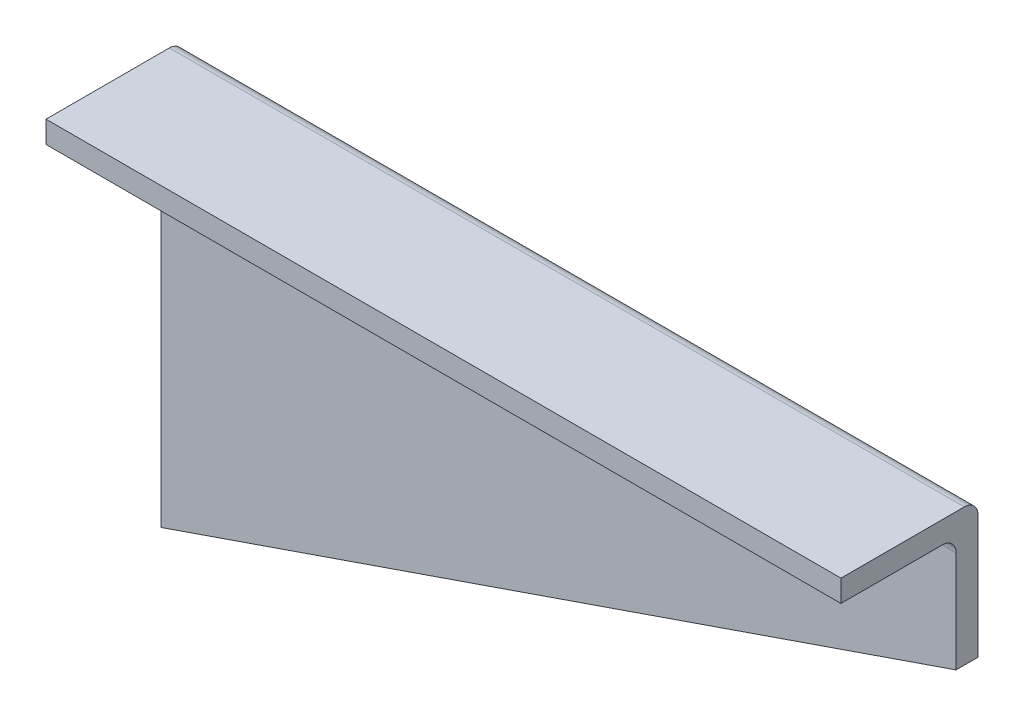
ISO-10303-21;
HEADER;
FILE_DESCRIPTION(('STEP AP214'),'2;1');
FILE_NAME('part.step','',(''),(''),'','','');
FILE_SCHEMA(('AUTOMOTIVE_DESIGN { 1 0 10303 214 1 1 1 1 }'));
ENDSEC;
DATA;
#1=APPLICATION_CONTEXT('core data for automotive mechanical design processes');
#2=APPLICATION_PROTOCOL_DEFINITION('international standard','automotive_design',2000,#1);
#3=PRODUCT_CONTEXT('',#1,'mechanical');
#4=PRODUCT('Part','Part','',(#3));
#5=PRODUCT_RELATED_PRODUCT_CATEGORY('part','',(#4));
#6=PRODUCT_DEFINITION_FORMATION('','',#4);
#7=PRODUCT_DEFINITION_CONTEXT('part definition',#1,'design');
#8=PRODUCT_DEFINITION('design','',#6,#7);
#9=PRODUCT_DEFINITION_SHAPE('','',#8);
#10=(LENGTH_UNIT() NAMED_UNIT(*) SI_UNIT(.MILLI.,.METRE.));
#11=(NAMED_UNIT(*) PLANE_ANGLE_UNIT() SI_UNIT($,.RADIAN.));
#12=(NAMED_UNIT(*) SI_UNIT($,.STERADIAN.) SOLID_ANGLE_UNIT());
#13=UNCERTAINTY_MEASURE_WITH_UNIT(LENGTH_MEASURE(1.E-05),#10,'distance_accuracy_value','');
#14=(GEOMETRIC_REPRESENTATION_CONTEXT(3) GLOBAL_UNCERTAINTY_ASSIGNED_CONTEXT((#13)) GLOBAL_UNIT_ASSIGNED_CONTEXT((#10,
#11,#12)) REPRESENTATION_CONTEXT('',''));
#15=CARTESIAN_POINT('',(0.,0.,0.));
#16=DIRECTION('',(0.,0.,1.));
#17=DIRECTION('',(1.,0.,0.));
#18=AXIS2_PLACEMENT_3D('',#15,#16,#17);
#19=CARTESIAN_POINT('',(290.,0.,8.00000000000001));
#20=DIRECTION('',(0.,-1.,0.));
#21=DIRECTION('',(1.,0.,0.));
#22=AXIS2_PLACEMENT_3D('',#19,#20,#21);
#23=PLANE('',#22);
#24=DIRECTION('',(0.,0.,-1.));
#25=VECTOR('',#24,1.);
#26=CARTESIAN_POINT('',(290.,0.,8.00000000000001));
#27=LINE('',#26,#25);
#28=CARTESIAN_POINT('',(290.,0.,50.));
#29=VERTEX_POINT('',#28);
#30=CARTESIAN_POINT('',(290.,0.,5.));
#31=VERTEX_POINT('',#30);
#32=EDGE_CURVE('E165',#29,#31,#27,.T.);
#33=ORIENTED_EDGE('',*,*,#32,.T.);
#34=DIRECTION('',(-1.,0.,0.));
#35=VECTOR('',#34,1.);
#36=CARTESIAN_POINT('',(290.,0.,5.));
#37=LINE('',#36,#35);
#38=CARTESIAN_POINT('',(0.,0.,5.));
#39=VERTEX_POINT('',#38);
#40=EDGE_CURVE('E182',#31,#39,#37,.T.);
#41=ORIENTED_EDGE('',*,*,#40,.T.);
#42=DIRECTION('',(0.,0.,-1.));
#43=VECTOR('',#42,1.);
#44=CARTESIAN_POINT('',(0.,0.,8.00000000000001));
#45=LINE('',#44,#43);
#46=CARTESIAN_POINT('',(0.,0.,50.));
#47=VERTEX_POINT('',#46);
#48=EDGE_CURVE('E150',#47,#39,#45,.T.);
#49=ORIENTED_EDGE('',*,*,#48,.F.);
#50=DIRECTION('',(-1.,0.,0.));
#51=VECTOR('',#50,1.);
#52=CARTESIAN_POINT('',(0.,0.,50.));
#53=LINE('',#52,#51);
#54=EDGE_CURVE('E124',#29,#47,#53,.T.);
#55=ORIENTED_EDGE('',*,*,#54,.F.);
#56=EDGE_LOOP('',(#33,#41,#49,#55));
#57=FACE_BOUND('',#56,.T.);
#58=ADVANCED_FACE('F41',(#57),#23,.F.);
#59=CARTESIAN_POINT('',(0.,0.,8.00000000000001));
#60=DIRECTION('',(1.,0.,0.));
#61=DIRECTION('',(0.,1.,0.));
#62=AXIS2_PLACEMENT_3D('',#59,#60,#61);
#63=PLANE('',#62);
#64=ORIENTED_EDGE('',*,*,#48,.T.);
#65=CARTESIAN_POINT('',(0.,-5.,5.));
#66=DIRECTION('',(1.,0.,0.));
#67=DIRECTION('',(0.,1.,0.));
#68=AXIS2_PLACEMENT_3D('',#65,#66,#67);
#69=CIRCLE('',#68,5.);
#70=CARTESIAN_POINT('',(0.,-5.,0.));
#71=VERTEX_POINT('',#70);
#72=EDGE_CURVE('E63',#39,#71,#69,.F.);
#73=ORIENTED_EDGE('',*,*,#72,.T.);
#74=DIRECTION('',(0.,-1.,0.));
#75=VECTOR('',#74,1.);
#76=CARTESIAN_POINT('',(0.,0.,0.));
#77=LINE('',#76,#75);
#78=CARTESIAN_POINT('',(0.,-150.,0.));
#79=VERTEX_POINT('',#78);
#80=EDGE_CURVE('E130',#71,#79,#77,.T.);
#81=ORIENTED_EDGE('',*,*,#80,.T.);
#82=DIRECTION('',(0.,0.,-1.));
#83=VECTOR('',#82,1.);
#84=CARTESIAN_POINT('',(0.,-150.,8.00000000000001));
#85=LINE('',#84,#83);
#86=CARTESIAN_POINT('',(0.,-150.,8.00000000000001));
#87=VERTEX_POINT('',#86);
#88=EDGE_CURVE('E171',#87,#79,#85,.T.);
#89=ORIENTED_EDGE('',*,*,#88,.F.);
#90=DIRECTION('',(0.,-1.,0.));
#91=VECTOR('',#90,1.);
#92=CARTESIAN_POINT('',(0.,0.,8.00000000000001));
#93=LINE('',#92,#91);
#94=CARTESIAN_POINT('',(0.,-13.,8.00000000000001));
#95=VERTEX_POINT('',#94);
#96=EDGE_CURVE('E151',#95,#87,#93,.T.);
#97=ORIENTED_EDGE('',*,*,#96,.F.);
#98=CARTESIAN_POINT('',(0.,-13.,13.));
#99=DIRECTION('',(1.,0.,0.));
#100=DIRECTION('',(0.,1.,0.));
#101=AXIS2_PLACEMENT_3D('',#98,#99,#100);
#102=CIRCLE('',#101,5.);
#103=CARTESIAN_POINT('',(0.,-7.99999999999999,13.));
#104=VERTEX_POINT('',#103);
#105=EDGE_CURVE('E11',#95,#104,#102,.T.);
#106=ORIENTED_EDGE('',*,*,#105,.T.);
#107=DIRECTION('',(0.,0.,-0.999999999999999));
#108=VECTOR('',#107,1.);
#109=CARTESIAN_POINT('',(0.,-8.00000000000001,50.));
#110=LINE('',#109,#108);
#111=CARTESIAN_POINT('',(0.,-8.00000000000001,50.));
#112=VERTEX_POINT('',#111);
#113=EDGE_CURVE('E110',#112,#104,#110,.T.);
#114=ORIENTED_EDGE('',*,*,#113,.F.);
#115=DIRECTION('',(0.,-1.,0.));
#116=VECTOR('',#115,1.);
#117=CARTESIAN_POINT('',(0.,0.,50.));
#118=LINE('',#117,#116);
#119=EDGE_CURVE('E118',#47,#112,#118,.T.);
#120=ORIENTED_EDGE('',*,*,#119,.F.);
#121=EDGE_LOOP('',(#64,#73,#81,#89,#97,#106,#114,#120));
#122=FACE_BOUND('',#121,.T.);
#123=ADVANCED_FACE('F127',(#122),#63,.F.);
#124=CARTESIAN_POINT('',(0.,-150.,8.00000000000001));
#125=DIRECTION('',(-0.325990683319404,0.945372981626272,0.));
#126=DIRECTION('',(-0.945372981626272,-0.325990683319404,0.));
#127=AXIS2_PLACEMENT_3D('',#124,#125,#126);
#128=PLANE('',#127);
#129=DIRECTION('',(0.945372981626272,0.325990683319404,0.));
#130=VECTOR('',#129,1.);
#131=CARTESIAN_POINT('',(0.,-150.,0.));
#132=LINE('',#131,#130);
#133=CARTESIAN_POINT('',(290.,-50.,0.));
#134=VERTEX_POINT('',#133);
#135=EDGE_CURVE('E132',#79,#134,#132,.T.);
#136=ORIENTED_EDGE('',*,*,#135,.T.);
#137=DIRECTION('',(0.,0.,-1.));
#138=VECTOR('',#137,1.);
#139=CARTESIAN_POINT('',(290.,-50.,8.00000000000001));
#140=LINE('',#139,#138);
#141=CARTESIAN_POINT('',(290.,-50.,8.00000000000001));
#142=VERTEX_POINT('',#141);
#143=EDGE_CURVE('E173',#142,#134,#140,.T.);
#144=ORIENTED_EDGE('',*,*,#143,.F.);
#145=DIRECTION('',(0.945372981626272,0.325990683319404,0.));
#146=VECTOR('',#145,1.);
#147=CARTESIAN_POINT('',(0.,-150.,8.00000000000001));
#148=LINE('',#147,#146);
#149=EDGE_CURVE('E154',#87,#142,#148,.T.);
#150=ORIENTED_EDGE('',*,*,#149,.F.);
#151=ORIENTED_EDGE('',*,*,#88,.T.);
#152=EDGE_LOOP('',(#136,#144,#150,#151));
#153=FACE_BOUND('',#152,.T.);
#154=ADVANCED_FACE('F212',(#153),#128,.F.);
#155=CARTESIAN_POINT('',(290.,-50.,8.00000000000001));
#156=DIRECTION('',(-1.,0.,0.));
#157=DIRECTION('',(0.,-1.,0.));
#158=AXIS2_PLACEMENT_3D('',#155,#156,#157);
#159=PLANE('',#158);
#160=DIRECTION('',(0.,1.,0.));
#161=VECTOR('',#160,1.);
#162=CARTESIAN_POINT('',(290.,-50.,0.));
#163=LINE('',#162,#161);
#164=CARTESIAN_POINT('',(290.,-4.99999999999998,0.));
#165=VERTEX_POINT('',#164);
#166=EDGE_CURVE('E155',#134,#165,#163,.T.);
#167=ORIENTED_EDGE('',*,*,#166,.T.);
#168=CARTESIAN_POINT('',(290.,-4.99999999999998,5.));
#169=DIRECTION('',(-1.,0.,0.));
#170=DIRECTION('',(0.,-1.,0.));
#171=AXIS2_PLACEMENT_3D('',#168,#169,#170);
#172=CIRCLE('',#171,5.);
#173=EDGE_CURVE('E186',#165,#31,#172,.F.);
#174=ORIENTED_EDGE('',*,*,#173,.T.);
#175=ORIENTED_EDGE('',*,*,#32,.F.);
#176=DIRECTION('',(0.,1.,0.));
#177=VECTOR('',#176,1.);
#178=CARTESIAN_POINT('',(290.,0.,50.));
#179=LINE('',#178,#177);
#180=CARTESIAN_POINT('',(290.,-7.99999999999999,50.));
#181=VERTEX_POINT('',#180);
#182=EDGE_CURVE('E117',#181,#29,#179,.T.);
#183=ORIENTED_EDGE('',*,*,#182,.F.);
#184=DIRECTION('',(0.,0.,-0.999999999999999));
#185=VECTOR('',#184,1.);
#186=CARTESIAN_POINT('',(290.,-7.99999999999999,50.));
#187=LINE('',#186,#185);
#188=CARTESIAN_POINT('',(290.,-7.99999999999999,13.));
#189=VERTEX_POINT('',#188);
#190=EDGE_CURVE('E113',#181,#189,#187,.T.);
#191=ORIENTED_EDGE('',*,*,#190,.T.);
#192=CARTESIAN_POINT('',(290.,-13.,13.));
#193=DIRECTION('',(-1.,0.,0.));
#194=DIRECTION('',(0.,-1.,0.));
#195=AXIS2_PLACEMENT_3D('',#192,#193,#194);
#196=CIRCLE('',#195,5.);
#197=CARTESIAN_POINT('',(290.,-13.,8.00000000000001));
#198=VERTEX_POINT('',#197);
#199=EDGE_CURVE('E48',#189,#198,#196,.T.);
#200=ORIENTED_EDGE('',*,*,#199,.T.);
#201=DIRECTION('',(0.,1.,0.));
#202=VECTOR('',#201,1.);
#203=CARTESIAN_POINT('',(290.,-50.,8.00000000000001));
#204=LINE('',#203,#202);
#205=EDGE_CURVE('E162',#142,#198,#204,.T.);
#206=ORIENTED_EDGE('',*,*,#205,.F.);
#207=ORIENTED_EDGE('',*,*,#143,.T.);
#208=EDGE_LOOP('',(#167,#174,#175,#183,#191,#200,#206,#207));
#209=FACE_BOUND('',#208,.T.);
#210=ADVANCED_FACE('F190',(#209),#159,.F.);
#211=CARTESIAN_POINT('',(0.,0.,8.00000000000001));
#212=DIRECTION('',(0.,0.,1.));
#213=DIRECTION('',(1.,0.,0.));
#214=AXIS2_PLACEMENT_3D('',#211,#212,#213);
#215=PLANE('',#214);
#216=CARTESIAN_POINT('',(180.,-30.,7.99999999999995));
#217=DIRECTION('',(0.,0.,1.));
#218=DIRECTION('',(1.,0.,0.));
#219=AXIS2_PLACEMENT_3D('',#216,#217,#218);
#220=CIRCLE('',#219,6.50000000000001);
#221=CARTESIAN_POINT('',(186.5,-30.,7.99999999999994));
#222=VERTEX_POINT('',#221);
#223=EDGE_CURVE('E146',#222,#222,#220,.T.);
#224=ORIENTED_EDGE('',*,*,#223,.F.);
#225=EDGE_LOOP('',(#224));
#226=FACE_BOUND('',#225,.T.);
#227=CARTESIAN_POINT('',(250.,-30.,8.00000000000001));
#228=DIRECTION('',(0.,0.,1.));
#229=DIRECTION('',(1.,0.,0.));
#230=AXIS2_PLACEMENT_3D('',#227,#228,#229);
#231=CIRCLE('',#230,6.50000000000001);
#232=CARTESIAN_POINT('',(256.5,-30.,8.));
#233=VERTEX_POINT('',#232);
#234=EDGE_CURVE('E142',#233,#233,#231,.T.);
#235=ORIENTED_EDGE('',*,*,#234,.F.);
#236=EDGE_LOOP('',(#235));
#237=FACE_BOUND('',#236,.T.);
#238=ORIENTED_EDGE('',*,*,#205,.T.);
#239=DIRECTION('',(1.,0.,0.));
#240=VECTOR('',#239,1.);
#241=CARTESIAN_POINT('',(0.,-13.,8.00000000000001));
#242=LINE('',#241,#240);
#243=EDGE_CURVE('E149',#198,#95,#242,.F.);
#244=ORIENTED_EDGE('',*,*,#243,.T.);
#245=ORIENTED_EDGE('',*,*,#96,.T.);
#246=ORIENTED_EDGE('',*,*,#149,.T.);
#247=EDGE_LOOP('',(#238,#244,#245,#246));
#248=FACE_BOUND('',#247,.T.);
#249=ADVANCED_FACE('F194',(#226,#237,#248),#215,.T.);
#250=CARTESIAN_POINT('',(0.,0.,0.));
#251=DIRECTION('',(0.,0.,1.));
#252=DIRECTION('',(1.,0.,0.));
#253=AXIS2_PLACEMENT_3D('',#250,#251,#252);
#254=PLANE('',#253);
#255=CARTESIAN_POINT('',(180.,-30.,0.));
#256=DIRECTION('',(0.,0.,1.));
#257=DIRECTION('',(1.,0.,0.));
#258=AXIS2_PLACEMENT_3D('',#255,#256,#257);
#259=CIRCLE('',#258,6.50000000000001);
#260=CARTESIAN_POINT('',(186.5,-30.,0.));
#261=VERTEX_POINT('',#260);
#262=EDGE_CURVE('E143',#261,#261,#259,.T.);
#263=ORIENTED_EDGE('',*,*,#262,.T.);
#264=EDGE_LOOP('',(#263));
#265=FACE_BOUND('',#264,.T.);
#266=CARTESIAN_POINT('',(250.,-30.,0.));
#267=DIRECTION('',(0.,0.,1.));
#268=DIRECTION('',(1.,0.,0.));
#269=AXIS2_PLACEMENT_3D('',#266,#267,#268);
#270=CIRCLE('',#269,6.50000000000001);
#271=CARTESIAN_POINT('',(256.5,-30.,0.));
#272=VERTEX_POINT('',#271);
#273=EDGE_CURVE('E125',#272,#272,#270,.T.);
#274=ORIENTED_EDGE('',*,*,#273,.T.);
#275=EDGE_LOOP('',(#274));
#276=FACE_BOUND('',#275,.T.);
#277=ORIENTED_EDGE('',*,*,#80,.F.);
#278=DIRECTION('',(-1.,0.,0.));
#279=VECTOR('',#278,1.);
#280=CARTESIAN_POINT('',(0.,-5.,0.));
#281=LINE('',#280,#279);
#282=EDGE_CURVE('E55',#71,#165,#281,.F.);
#283=ORIENTED_EDGE('',*,*,#282,.T.);
#284=ORIENTED_EDGE('',*,*,#166,.F.);
#285=ORIENTED_EDGE('',*,*,#135,.F.);
#286=EDGE_LOOP('',(#277,#283,#284,#285));
#287=FACE_BOUND('',#286,.T.);
#288=ADVANCED_FACE('F223',(#265,#276,#287),#254,.F.);
#289=CARTESIAN_POINT('',(0.,-8.00000000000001,50.));
#290=DIRECTION('',(0.,1.,0.));
#291=DIRECTION('',(0.,0.,1.));
#292=AXIS2_PLACEMENT_3D('',#289,#290,#291);
#293=PLANE('',#292);
#294=ORIENTED_EDGE('',*,*,#113,.T.);
#295=DIRECTION('',(1.,0.,0.));
#296=VECTOR('',#295,1.);
#297=CARTESIAN_POINT('',(0.,-7.99999999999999,13.));
#298=LINE('',#297,#296);
#299=EDGE_CURVE('E147',#104,#189,#298,.T.);
#300=ORIENTED_EDGE('',*,*,#299,.T.);
#301=ORIENTED_EDGE('',*,*,#190,.F.);
#302=DIRECTION('',(1.,0.,0.));
#303=VECTOR('',#302,1.);
#304=CARTESIAN_POINT('',(0.,-8.00000000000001,50.));
#305=LINE('',#304,#303);
#306=EDGE_CURVE('E105',#112,#181,#305,.T.);
#307=ORIENTED_EDGE('',*,*,#306,.F.);
#308=EDGE_LOOP('',(#294,#300,#301,#307));
#309=FACE_BOUND('',#308,.T.);
#310=ADVANCED_FACE('F107',(#309),#293,.F.);
#311=CARTESIAN_POINT('',(0.,-8.00000000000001,50.));
#312=DIRECTION('',(0.,0.,1.));
#313=DIRECTION('',(1.,0.,0.));
#314=AXIS2_PLACEMENT_3D('',#311,#312,#313);
#315=PLANE('',#314);
#316=ORIENTED_EDGE('',*,*,#119,.T.);
#317=ORIENTED_EDGE('',*,*,#306,.T.);
#318=ORIENTED_EDGE('',*,*,#182,.T.);
#319=ORIENTED_EDGE('',*,*,#54,.T.);
#320=EDGE_LOOP('',(#316,#317,#318,#319));
#321=FACE_BOUND('',#320,.T.);
#322=ADVANCED_FACE('F122',(#321),#315,.T.);
#323=CARTESIAN_POINT('',(250.,-30.,-34.));
#324=DIRECTION('',(0.,0.,0.999999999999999));
#325=DIRECTION('',(1.,0.,0.));
#326=AXIS2_PLACEMENT_3D('',#323,#324,#325);
#327=CYLINDRICAL_SURFACE('',#326,6.50000000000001);
#328=CARTESIAN_POINT('',(256.5,-30.,8.));
#329=CARTESIAN_POINT('',(256.5,-30.,7.91666666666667));
#330=CARTESIAN_POINT('',(256.5,-30.,7.83333333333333));
#331=CARTESIAN_POINT('',(256.5,-30.,7.66666666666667));
#332=CARTESIAN_POINT('',(256.5,-30.,7.58333333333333));
#333=CARTESIAN_POINT('',(256.5,-30.,7.41666666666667));
#334=CARTESIAN_POINT('',(256.5,-30.,7.33333333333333));
#335=CARTESIAN_POINT('',(256.5,-30.,7.16666666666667));
#336=CARTESIAN_POINT('',(256.5,-30.,7.08333333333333));
#337=CARTESIAN_POINT('',(256.5,-30.,6.91666666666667));
#338=CARTESIAN_POINT('',(256.5,-30.,6.83333333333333));
#339=CARTESIAN_POINT('',(256.5,-30.,6.66666666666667));
#340=CARTESIAN_POINT('',(256.5,-30.,6.58333333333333));
#341=CARTESIAN_POINT('',(256.5,-30.,6.41666666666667));
#342=CARTESIAN_POINT('',(256.5,-30.,6.33333333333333));
#343=CARTESIAN_POINT('',(256.5,-30.,6.16666666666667));
#344=CARTESIAN_POINT('',(256.5,-30.,6.08333333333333));
#345=CARTESIAN_POINT('',(256.5,-30.,5.91666666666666));
#346=CARTESIAN_POINT('',(256.5,-30.,5.83333333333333));
#347=CARTESIAN_POINT('',(256.5,-30.,5.66666666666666));
#348=CARTESIAN_POINT('',(256.5,-30.,5.58333333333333));
#349=CARTESIAN_POINT('',(256.5,-30.,5.41666666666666));
#350=CARTESIAN_POINT('',(256.5,-30.,5.33333333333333));
#351=CARTESIAN_POINT('',(256.5,-30.,5.16666666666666));
#352=CARTESIAN_POINT('',(256.5,-30.,5.08333333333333));
#353=CARTESIAN_POINT('',(256.5,-30.,4.91666666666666));
#354=CARTESIAN_POINT('',(256.5,-30.,4.83333333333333));
#355=CARTESIAN_POINT('',(256.5,-30.,4.66666666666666));
#356=CARTESIAN_POINT('',(256.5,-30.,4.58333333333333));
#357=CARTESIAN_POINT('',(256.5,-30.,4.41666666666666));
#358=CARTESIAN_POINT('',(256.5,-30.,4.33333333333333));
#359=CARTESIAN_POINT('',(256.5,-30.,4.16666666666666));
#360=CARTESIAN_POINT('',(256.5,-30.,4.08333333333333));
#361=CARTESIAN_POINT('',(256.5,-30.,3.91666666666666));
#362=CARTESIAN_POINT('',(256.5,-30.,3.83333333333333));
#363=CARTESIAN_POINT('',(256.5,-30.,3.66666666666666));
#364=CARTESIAN_POINT('',(256.5,-30.,3.58333333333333));
#365=CARTESIAN_POINT('',(256.5,-30.,3.41666666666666));
#366=CARTESIAN_POINT('',(256.5,-30.,3.33333333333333));
#367=CARTESIAN_POINT('',(256.5,-30.,3.16666666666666));
#368=CARTESIAN_POINT('',(256.5,-30.,3.08333333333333));
#369=CARTESIAN_POINT('',(256.5,-30.,2.91666666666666));
#370=CARTESIAN_POINT('',(256.5,-30.,2.83333333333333));
#371=CARTESIAN_POINT('',(256.5,-30.,2.66666666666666));
#372=CARTESIAN_POINT('',(256.5,-30.,2.58333333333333));
#373=CARTESIAN_POINT('',(256.5,-30.,2.41666666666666));
#374=CARTESIAN_POINT('',(256.5,-30.,2.33333333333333));
#375=CARTESIAN_POINT('',(256.5,-30.,2.16666666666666));
#376=CARTESIAN_POINT('',(256.5,-30.,2.08333333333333));
#377=CARTESIAN_POINT('',(256.5,-30.,1.91666666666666));
#378=CARTESIAN_POINT('',(256.5,-30.,1.83333333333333));
#379=CARTESIAN_POINT('',(256.5,-30.,1.66666666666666));
#380=CARTESIAN_POINT('',(256.5,-30.,1.58333333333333));
#381=CARTESIAN_POINT('',(256.5,-30.,1.41666666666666));
#382=CARTESIAN_POINT('',(256.5,-30.,1.33333333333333));
#383=CARTESIAN_POINT('',(256.5,-30.,1.16666666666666));
#384=CARTESIAN_POINT('',(256.5,-30.,1.08333333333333));
#385=CARTESIAN_POINT('',(256.5,-30.,0.916666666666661));
#386=CARTESIAN_POINT('',(256.5,-30.,0.833333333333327));
#387=CARTESIAN_POINT('',(256.5,-30.,0.66666666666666));
#388=CARTESIAN_POINT('',(256.5,-30.,0.583333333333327));
#389=CARTESIAN_POINT('',(256.5,-30.,0.41666666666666));
#390=CARTESIAN_POINT('',(256.5,-30.,0.333333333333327));
#391=CARTESIAN_POINT('',(256.5,-30.,0.16666666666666));
#392=CARTESIAN_POINT('',(256.5,-30.,0.0833333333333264));
#393=CARTESIAN_POINT('',(256.5,-30.,0.));
#394=B_SPLINE_CURVE_WITH_KNOTS('',3,(#328,#329,#330,#331,#332,#333,#334,#335,#336,#337,#338,
#339,#340,#341,#342,#343,#344,#345,#346,#347,#348,#349,#350,#351,#352,#353,#354,#355,#356,#357,
#358,#359,#360,#361,#362,#363,#364,#365,#366,#367,#368,#369,#370,#371,#372,#373,#374,#375,#376,
#377,#378,#379,#380,#381,#382,#383,#384,#385,#386,#387,#388,#389,#390,#391,#392,#393),
.UNSPECIFIED.,.F.,.F.,(4,2,2,2,2,2,2,2,2,2,2,2,2,2,2,2,2,2,2,2,2,2,2,2,2,2,2,2,2,2,2,2,4),(0.,
0.25,0.5,0.750000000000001,1.,1.25,1.5,1.75,2.,2.25,2.5,2.75,3.,3.25,3.5,3.75,4.,4.25,4.5,4.75,
5.,5.25,5.50000000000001,5.75000000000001,6.00000000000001,6.25000000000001,6.50000000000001,
6.75000000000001,7.00000000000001,7.25000000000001,7.50000000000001,7.75000000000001,
8.00000000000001),.UNSPECIFIED.);
#395=EDGE_CURVE('BSEAM205',#233,#272,#394,.T.);
#396=ORIENTED_EDGE('',*,*,#234,.T.);
#397=ORIENTED_EDGE('',*,*,#273,.F.);
#398=ORIENTED_EDGE('',*,*,#395,.T.);
#399=ORIENTED_EDGE('',*,*,#395,.F.);
#400=EDGE_LOOP('',(#396,#398,#397,#399));
#401=FACE_BOUND('',#400,.T.);
#402=ADVANCED_FACE('F205',(#401),#327,.F.);
#403=CARTESIAN_POINT('',(180.,-30.,-34.));
#404=DIRECTION('',(0.,0.,0.999999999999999));
#405=DIRECTION('',(1.,0.,0.));
#406=AXIS2_PLACEMENT_3D('',#403,#404,#405);
#407=CYLINDRICAL_SURFACE('',#406,6.50000000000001);
#408=CARTESIAN_POINT('',(186.5,-30.,7.99999999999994));
#409=CARTESIAN_POINT('',(186.5,-30.,7.91666666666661));
#410=CARTESIAN_POINT('',(186.5,-30.,7.83333333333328));
#411=CARTESIAN_POINT('',(186.5,-30.,7.66666666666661));
#412=CARTESIAN_POINT('',(186.5,-30.,7.58333333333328));
#413=CARTESIAN_POINT('',(186.5,-30.,7.41666666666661));
#414=CARTESIAN_POINT('',(186.5,-30.,7.33333333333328));
#415=CARTESIAN_POINT('',(186.5,-30.,7.16666666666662));
#416=CARTESIAN_POINT('',(186.5,-30.,7.08333333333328));
#417=CARTESIAN_POINT('',(186.5,-30.,6.91666666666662));
#418=CARTESIAN_POINT('',(186.5,-30.,6.83333333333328));
#419=CARTESIAN_POINT('',(186.5,-30.,6.66666666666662));
#420=CARTESIAN_POINT('',(186.5,-30.,6.58333333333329));
#421=CARTESIAN_POINT('',(186.5,-30.,6.41666666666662));
#422=CARTESIAN_POINT('',(186.5,-30.,6.33333333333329));
#423=CARTESIAN_POINT('',(186.5,-30.,6.16666666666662));
#424=CARTESIAN_POINT('',(186.5,-30.,6.08333333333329));
#425=CARTESIAN_POINT('',(186.5,-30.,5.91666666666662));
#426=CARTESIAN_POINT('',(186.5,-30.,5.83333333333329));
#427=CARTESIAN_POINT('',(186.5,-30.,5.66666666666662));
#428=CARTESIAN_POINT('',(186.5,-30.,5.58333333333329));
#429=CARTESIAN_POINT('',(186.5,-30.,5.41666666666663));
#430=CARTESIAN_POINT('',(186.5,-30.,5.33333333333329));
#431=CARTESIAN_POINT('',(186.5,-30.,5.16666666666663));
#432=CARTESIAN_POINT('',(186.5,-30.,5.0833333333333));
#433=CARTESIAN_POINT('',(186.5,-30.,4.91666666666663));
#434=CARTESIAN_POINT('',(186.5,-30.,4.8333333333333));
#435=CARTESIAN_POINT('',(186.5,-30.,4.66666666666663));
#436=CARTESIAN_POINT('',(186.5,-30.,4.5833333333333));
#437=CARTESIAN_POINT('',(186.5,-30.,4.41666666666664));
#438=CARTESIAN_POINT('',(186.5,-30.,4.3333333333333));
#439=CARTESIAN_POINT('',(186.5,-30.,4.16666666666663));
#440=CARTESIAN_POINT('',(186.5,-30.,4.0833333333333));
#441=CARTESIAN_POINT('',(186.5,-30.,3.91666666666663));
#442=CARTESIAN_POINT('',(186.5,-30.,3.8333333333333));
#443=CARTESIAN_POINT('',(186.5,-30.,3.66666666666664));
#444=CARTESIAN_POINT('',(186.5,-30.,3.5833333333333));
#445=CARTESIAN_POINT('',(186.5,-30.,3.41666666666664));
#446=CARTESIAN_POINT('',(186.5,-30.,3.33333333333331));
#447=CARTESIAN_POINT('',(186.5,-30.,3.16666666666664));
#448=CARTESIAN_POINT('',(186.5,-30.,3.08333333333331));
#449=CARTESIAN_POINT('',(186.5,-30.,2.91666666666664));
#450=CARTESIAN_POINT('',(186.5,-30.,2.83333333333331));
#451=CARTESIAN_POINT('',(186.5,-30.,2.66666666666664));
#452=CARTESIAN_POINT('',(186.5,-30.,2.58333333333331));
#453=CARTESIAN_POINT('',(186.5,-30.,2.41666666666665));
#454=CARTESIAN_POINT('',(186.5,-30.,2.33333333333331));
#455=CARTESIAN_POINT('',(186.5,-30.,2.16666666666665));
#456=CARTESIAN_POINT('',(186.5,-30.,2.08333333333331));
#457=CARTESIAN_POINT('',(186.5,-30.,1.91666666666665));
#458=CARTESIAN_POINT('',(186.5,-30.,1.83333333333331));
#459=CARTESIAN_POINT('',(186.5,-30.,1.66666666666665));
#460=CARTESIAN_POINT('',(186.5,-30.,1.58333333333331));
#461=CARTESIAN_POINT('',(186.5,-30.,1.41666666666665));
#462=CARTESIAN_POINT('',(186.5,-30.,1.33333333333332));
#463=CARTESIAN_POINT('',(186.5,-30.,1.16666666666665));
#464=CARTESIAN_POINT('',(186.5,-30.,1.08333333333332));
#465=CARTESIAN_POINT('',(186.5,-30.,0.916666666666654));
#466=CARTESIAN_POINT('',(186.5,-30.,0.83333333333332));
#467=CARTESIAN_POINT('',(186.5,-30.,0.666666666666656));
#468=CARTESIAN_POINT('',(186.5,-30.,0.583333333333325));
#469=CARTESIAN_POINT('',(186.5,-30.,0.41666666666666));
#470=CARTESIAN_POINT('',(186.5,-30.,0.333333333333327));
#471=CARTESIAN_POINT('',(186.5,-30.,0.16666666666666));
#472=CARTESIAN_POINT('',(186.5,-30.,0.0833333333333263));
#473=CARTESIAN_POINT('',(186.5,-30.,0.));
#474=B_SPLINE_CURVE_WITH_KNOTS('',3,(#408,#409,#410,#411,#412,#413,#414,#415,#416,#417,#418,
#419,#420,#421,#422,#423,#424,#425,#426,#427,#428,#429,#430,#431,#432,#433,#434,#435,#436,#437,
#438,#439,#440,#441,#442,#443,#444,#445,#446,#447,#448,#449,#450,#451,#452,#453,#454,#455,#456,
#457,#458,#459,#460,#461,#462,#463,#464,#465,#466,#467,#468,#469,#470,#471,#472,#473),
.UNSPECIFIED.,.F.,.F.,(4,2,2,2,2,2,2,2,2,2,2,2,2,2,2,2,2,2,2,2,2,2,2,2,2,2,2,2,2,2,2,2,4),(0.,
0.25,0.5,0.749999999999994,0.999999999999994,1.24999999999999,1.49999999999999,1.74999999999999,
1.99999999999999,2.24999999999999,2.49999999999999,2.74999999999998,2.99999999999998,
3.24999999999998,3.49999999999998,3.74999999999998,3.99999999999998,4.24999999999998,
4.49999999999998,4.74999999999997,4.99999999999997,5.24999999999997,5.49999999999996,
5.74999999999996,5.99999999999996,6.24999999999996,6.49999999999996,6.74999999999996,
6.99999999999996,7.24999999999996,7.49999999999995,7.74999999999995,7.99999999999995),.UNSPECIFIED.);
#475=EDGE_CURVE('BSEAM198',#222,#261,#474,.T.);
#476=ORIENTED_EDGE('',*,*,#223,.T.);
#477=ORIENTED_EDGE('',*,*,#262,.F.);
#478=ORIENTED_EDGE('',*,*,#475,.T.);
#479=ORIENTED_EDGE('',*,*,#475,.F.);
#480=EDGE_LOOP('',(#476,#478,#477,#479));
#481=FACE_BOUND('',#480,.T.);
#482=ADVANCED_FACE('F198',(#481),#407,.F.);
#483=CARTESIAN_POINT('',(0.,-13.,13.));
#484=DIRECTION('',(1.,0.,0.));
#485=DIRECTION('',(0.,0.,-1.));
#486=AXIS2_PLACEMENT_3D('',#483,#484,#485);
#487=CYLINDRICAL_SURFACE('',#486,5.);
#488=ORIENTED_EDGE('',*,*,#105,.F.);
#489=ORIENTED_EDGE('',*,*,#243,.F.);
#490=ORIENTED_EDGE('',*,*,#199,.F.);
#491=ORIENTED_EDGE('',*,*,#299,.F.);
#492=EDGE_LOOP('',(#488,#489,#490,#491));
#493=FACE_BOUND('',#492,.T.);
#494=ADVANCED_FACE('F196',(#493),#487,.F.);
#495=CARTESIAN_POINT('',(290.,-4.99999999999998,5.));
#496=DIRECTION('',(-1.,0.,0.));
#497=DIRECTION('',(0.,-1.,0.));
#498=AXIS2_PLACEMENT_3D('',#495,#496,#497);
#499=CYLINDRICAL_SURFACE('',#498,5.);
#500=ORIENTED_EDGE('',*,*,#173,.F.);
#501=ORIENTED_EDGE('',*,*,#282,.F.);
#502=ORIENTED_EDGE('',*,*,#72,.F.);
#503=ORIENTED_EDGE('',*,*,#40,.F.);
#504=EDGE_LOOP('',(#500,#501,#502,#503));
#505=FACE_BOUND('',#504,.T.);
#506=ADVANCED_FACE('F185',(#505),#499,.T.);
#507=CLOSED_SHELL('',(#58,#123,#154,#210,#249,#288,#310,#322,#402,#482,#494,#506));
#508=MANIFOLD_SOLID_BREP('B2',#507);
#509=ADVANCED_BREP_SHAPE_REPRESENTATION('',(#18,#508),#14);
#510=SHAPE_DEFINITION_REPRESENTATION(#9,#509);
ENDSEC;
END-ISO-10303-21;
